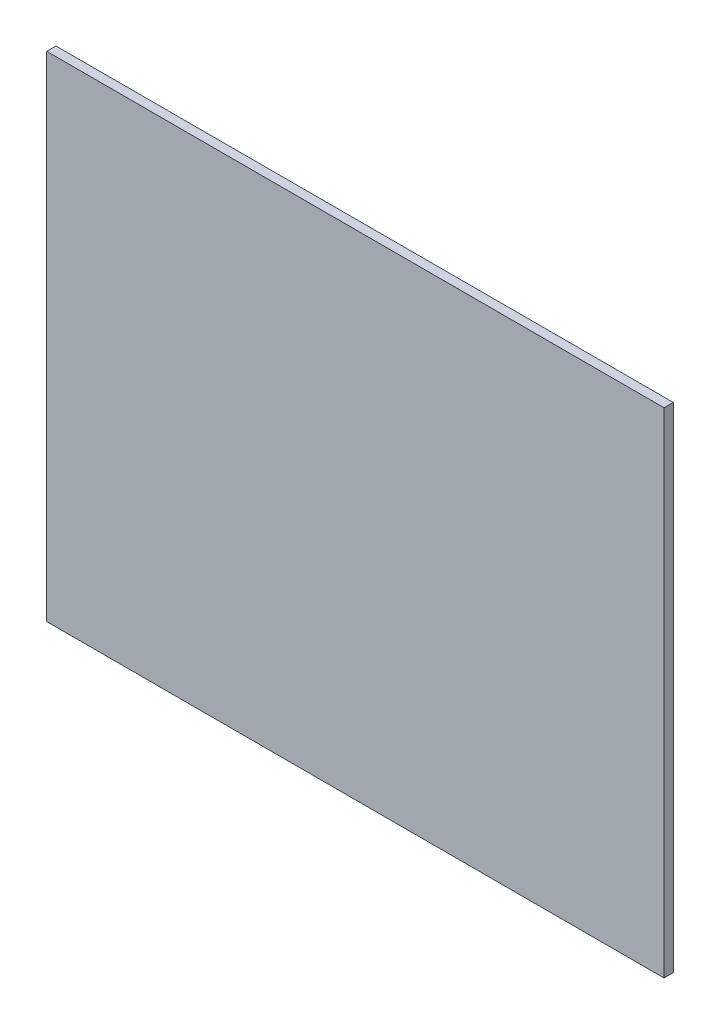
from build123d import *

# Parameters (mm, degrees)
SKETCH1_W           = 200
SKETCH1_H           = 160
BOSS_EXTRUDE1_DEPTH = 3


with BuildPart() as part:
    # Sketch1 → Boss-Extrude1 (new body)
    with BuildSketch(Plane.XY):
        Rectangle(SKETCH1_W, SKETCH1_H)
    extrude(amount=BOSS_EXTRUDE1_DEPTH)


solid = part.part
